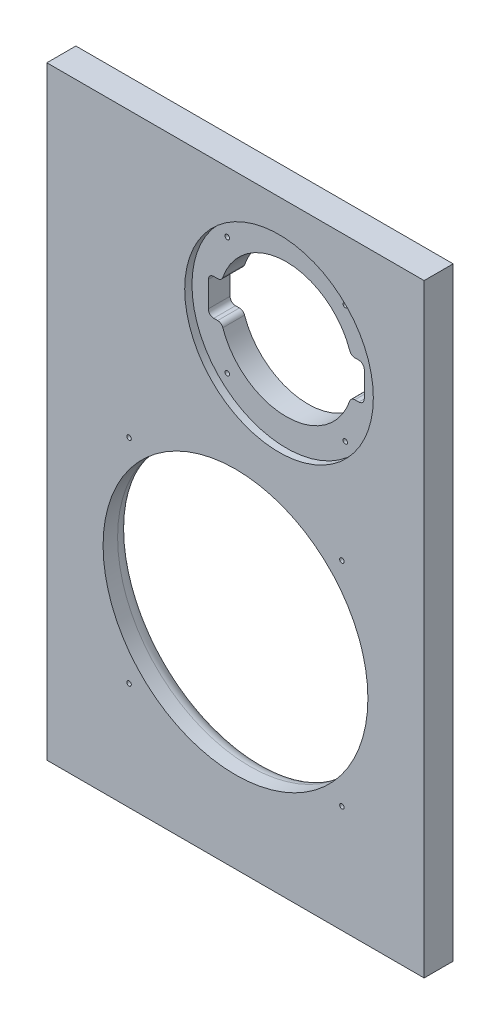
ISO-10303-21;
HEADER;
FILE_DESCRIPTION(('STEP AP214'),'2;1');
FILE_NAME('part.step','',(''),(''),'','','');
FILE_SCHEMA(('AUTOMOTIVE_DESIGN { 1 0 10303 214 1 1 1 1 }'));
ENDSEC;
DATA;
#1=APPLICATION_CONTEXT('core data for automotive mechanical design processes');
#2=APPLICATION_PROTOCOL_DEFINITION('international standard','automotive_design',2000,#1);
#3=PRODUCT_CONTEXT('',#1,'mechanical');
#4=PRODUCT('Part','Part','',(#3));
#5=PRODUCT_RELATED_PRODUCT_CATEGORY('part','',(#4));
#6=PRODUCT_DEFINITION_FORMATION('','',#4);
#7=PRODUCT_DEFINITION_CONTEXT('part definition',#1,'design');
#8=PRODUCT_DEFINITION('design','',#6,#7);
#9=PRODUCT_DEFINITION_SHAPE('','',#8);
#10=(LENGTH_UNIT() NAMED_UNIT(*) SI_UNIT(.MILLI.,.METRE.));
#11=(NAMED_UNIT(*) PLANE_ANGLE_UNIT() SI_UNIT($,.RADIAN.));
#12=(NAMED_UNIT(*) SI_UNIT($,.STERADIAN.) SOLID_ANGLE_UNIT());
#13=UNCERTAINTY_MEASURE_WITH_UNIT(LENGTH_MEASURE(1.E-05),#10,'distance_accuracy_value','');
#14=(GEOMETRIC_REPRESENTATION_CONTEXT(3) GLOBAL_UNCERTAINTY_ASSIGNED_CONTEXT((#13)) GLOBAL_UNIT_ASSIGNED_CONTEXT((#10,
#11,#12)) REPRESENTATION_CONTEXT('',''));
#15=CARTESIAN_POINT('',(0.,0.,0.));
#16=DIRECTION('',(0.,0.,1.));
#17=DIRECTION('',(1.,0.,0.));
#18=AXIS2_PLACEMENT_3D('',#15,#16,#17);
#19=CARTESIAN_POINT('',(208.,-10.,16.));
#20=DIRECTION('',(-1.,0.,0.));
#21=DIRECTION('',(0.,-1.,0.));
#22=AXIS2_PLACEMENT_3D('',#19,#20,#21);
#23=PLANE('',#22);
#24=DIRECTION('',(0.,1.,0.));
#25=VECTOR('',#24,1.);
#26=CARTESIAN_POINT('',(208.,-10.,0.));
#27=LINE('',#26,#25);
#28=CARTESIAN_POINT('',(208.,-343.,0.));
#29=VERTEX_POINT('',#28);
#30=CARTESIAN_POINT('',(208.,-10.,0.));
#31=VERTEX_POINT('',#30);
#32=EDGE_CURVE('E203',#29,#31,#27,.T.);
#33=ORIENTED_EDGE('',*,*,#32,.T.);
#34=DIRECTION('',(0.,0.,-1.));
#35=VECTOR('',#34,1.);
#36=CARTESIAN_POINT('',(208.,-10.,16.));
#37=LINE('',#36,#35);
#38=CARTESIAN_POINT('',(208.,-10.,16.));
#39=VERTEX_POINT('',#38);
#40=EDGE_CURVE('E174',#39,#31,#37,.T.);
#41=ORIENTED_EDGE('',*,*,#40,.F.);
#42=DIRECTION('',(0.,1.,0.));
#43=VECTOR('',#42,1.);
#44=CARTESIAN_POINT('',(208.,-10.,16.));
#45=LINE('',#44,#43);
#46=CARTESIAN_POINT('',(208.,-343.,16.));
#47=VERTEX_POINT('',#46);
#48=EDGE_CURVE('E204',#47,#39,#45,.T.);
#49=ORIENTED_EDGE('',*,*,#48,.F.);
#50=DIRECTION('',(0.,0.,-1.));
#51=VECTOR('',#50,1.);
#52=CARTESIAN_POINT('',(208.,-343.,16.));
#53=LINE('',#52,#51);
#54=EDGE_CURVE('E214',#47,#29,#53,.T.);
#55=ORIENTED_EDGE('',*,*,#54,.T.);
#56=EDGE_LOOP('',(#33,#41,#49,#55));
#57=FACE_BOUND('',#56,.T.);
#58=ADVANCED_FACE('F32',(#57),#23,.F.);
#59=CARTESIAN_POINT('',(0.,-10.,16.));
#60=DIRECTION('',(0.,-1.,0.));
#61=DIRECTION('',(0.,0.,-1.));
#62=AXIS2_PLACEMENT_3D('',#59,#60,#61);
#63=PLANE('',#62);
#64=DIRECTION('',(-1.,0.,0.));
#65=VECTOR('',#64,1.);
#66=CARTESIAN_POINT('',(0.,-10.,0.));
#67=LINE('',#66,#65);
#68=CARTESIAN_POINT('',(0.,-10.,0.));
#69=VERTEX_POINT('',#68);
#70=EDGE_CURVE('E217',#31,#69,#67,.T.);
#71=ORIENTED_EDGE('',*,*,#70,.T.);
#72=DIRECTION('',(0.,0.,-1.));
#73=VECTOR('',#72,1.);
#74=CARTESIAN_POINT('',(0.,-10.,16.));
#75=LINE('',#74,#73);
#76=CARTESIAN_POINT('',(0.,-10.,16.));
#77=VERTEX_POINT('',#76);
#78=EDGE_CURVE('E227',#77,#69,#75,.T.);
#79=ORIENTED_EDGE('',*,*,#78,.F.);
#80=DIRECTION('',(-1.,0.,0.));
#81=VECTOR('',#80,1.);
#82=CARTESIAN_POINT('',(0.,-10.,16.));
#83=LINE('',#82,#81);
#84=EDGE_CURVE('E207',#39,#77,#83,.T.);
#85=ORIENTED_EDGE('',*,*,#84,.F.);
#86=ORIENTED_EDGE('',*,*,#40,.T.);
#87=EDGE_LOOP('',(#71,#79,#85,#86));
#88=FACE_BOUND('',#87,.T.);
#89=ADVANCED_FACE('F266',(#88),#63,.F.);
#90=CARTESIAN_POINT('',(0.,-10.,16.));
#91=DIRECTION('',(1.,0.,0.));
#92=DIRECTION('',(0.,1.,0.));
#93=AXIS2_PLACEMENT_3D('',#90,#91,#92);
#94=PLANE('',#93);
#95=DIRECTION('',(0.,-1.,0.));
#96=VECTOR('',#95,1.);
#97=CARTESIAN_POINT('',(0.,-10.,0.));
#98=LINE('',#97,#96);
#99=CARTESIAN_POINT('',(0.,-343.,0.));
#100=VERTEX_POINT('',#99);
#101=EDGE_CURVE('E219',#69,#100,#98,.T.);
#102=ORIENTED_EDGE('',*,*,#101,.T.);
#103=DIRECTION('',(0.,0.,-1.));
#104=VECTOR('',#103,1.);
#105=CARTESIAN_POINT('',(0.,-343.,16.));
#106=LINE('',#105,#104);
#107=CARTESIAN_POINT('',(0.,-343.,16.));
#108=VERTEX_POINT('',#107);
#109=EDGE_CURVE('E224',#108,#100,#106,.T.);
#110=ORIENTED_EDGE('',*,*,#109,.F.);
#111=DIRECTION('',(0.,-1.,0.));
#112=VECTOR('',#111,1.);
#113=CARTESIAN_POINT('',(0.,-10.,16.));
#114=LINE('',#113,#112);
#115=EDGE_CURVE('E210',#77,#108,#114,.T.);
#116=ORIENTED_EDGE('',*,*,#115,.F.);
#117=ORIENTED_EDGE('',*,*,#78,.T.);
#118=EDGE_LOOP('',(#102,#110,#116,#117));
#119=FACE_BOUND('',#118,.T.);
#120=ADVANCED_FACE('F271',(#119),#94,.F.);
#121=CARTESIAN_POINT('',(0.,-343.,16.));
#122=DIRECTION('',(0.,1.,0.));
#123=DIRECTION('',(0.,0.,1.));
#124=AXIS2_PLACEMENT_3D('',#121,#122,#123);
#125=PLANE('',#124);
#126=DIRECTION('',(1.,0.,0.));
#127=VECTOR('',#126,1.);
#128=CARTESIAN_POINT('',(0.,-343.,0.));
#129=LINE('',#128,#127);
#130=EDGE_CURVE('E208',#100,#29,#129,.T.);
#131=ORIENTED_EDGE('',*,*,#130,.T.);
#132=ORIENTED_EDGE('',*,*,#54,.F.);
#133=DIRECTION('',(1.,0.,0.));
#134=VECTOR('',#133,1.);
#135=CARTESIAN_POINT('',(0.,-343.,16.));
#136=LINE('',#135,#134);
#137=EDGE_CURVE('E212',#108,#47,#136,.T.);
#138=ORIENTED_EDGE('',*,*,#137,.F.);
#139=ORIENTED_EDGE('',*,*,#109,.T.);
#140=EDGE_LOOP('',(#131,#132,#138,#139));
#141=FACE_BOUND('',#140,.T.);
#142=ADVANCED_FACE('F277',(#141),#125,.F.);
#143=CARTESIAN_POINT('',(208.,-343.,16.));
#144=DIRECTION('',(0.,0.,1.));
#145=DIRECTION('',(1.,0.,0.));
#146=AXIS2_PLACEMENT_3D('',#143,#144,#145);
#147=PLANE('',#146);
#148=CARTESIAN_POINT('',(162.689862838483,-283.687189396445,16.));
#149=DIRECTION('',(0.,0.,1.));
#150=DIRECTION('',(1.,0.,0.));
#151=AXIS2_PLACEMENT_3D('',#148,#149,#150);
#152=CIRCLE('',#151,1.25000000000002);
#153=CARTESIAN_POINT('',(163.939862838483,-283.687189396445,16.));
#154=VERTEX_POINT('',#153);
#155=EDGE_CURVE('E240',#154,#154,#152,.T.);
#156=ORIENTED_EDGE('',*,*,#155,.F.);
#157=EDGE_LOOP('',(#156));
#158=FACE_BOUND('',#157,.T.);
#159=CARTESIAN_POINT('',(162.689862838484,-166.307463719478,16.));
#160=DIRECTION('',(0.,0.,1.));
#161=DIRECTION('',(1.,0.,0.));
#162=AXIS2_PLACEMENT_3D('',#159,#160,#161);
#163=CIRCLE('',#162,1.24999999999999);
#164=CARTESIAN_POINT('',(163.939862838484,-166.307463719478,16.));
#165=VERTEX_POINT('',#164);
#166=EDGE_CURVE('E558',#165,#165,#163,.T.);
#167=ORIENTED_EDGE('',*,*,#166,.F.);
#168=EDGE_LOOP('',(#167));
#169=FACE_BOUND('',#168,.T.);
#170=CARTESIAN_POINT('',(45.3101371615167,-166.307463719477,16.));
#171=DIRECTION('',(0.,0.,1.));
#172=DIRECTION('',(1.,0.,0.));
#173=AXIS2_PLACEMENT_3D('',#170,#171,#172);
#174=CIRCLE('',#173,1.24999999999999);
#175=CARTESIAN_POINT('',(46.5601371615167,-166.307463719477,16.));
#176=VERTEX_POINT('',#175);
#177=EDGE_CURVE('E552',#176,#176,#174,.T.);
#178=ORIENTED_EDGE('',*,*,#177,.F.);
#179=EDGE_LOOP('',(#178));
#180=FACE_BOUND('',#179,.T.);
#181=CARTESIAN_POINT('',(45.3101371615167,-283.687189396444,16.));
#182=DIRECTION('',(0.,0.,1.));
#183=DIRECTION('',(1.,0.,0.));
#184=AXIS2_PLACEMENT_3D('',#181,#182,#183);
#185=CIRCLE('',#184,1.24999999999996);
#186=CARTESIAN_POINT('',(46.5601371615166,-283.687189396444,16.));
#187=VERTEX_POINT('',#186);
#188=EDGE_CURVE('E235',#187,#187,#185,.T.);
#189=ORIENTED_EDGE('',*,*,#188,.F.);
#190=EDGE_LOOP('',(#189));
#191=FACE_BOUND('',#190,.T.);
#192=CARTESIAN_POINT('',(128.,-79.997326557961,16.));
#193=DIRECTION('',(0.,0.,1.));
#194=DIRECTION('',(-1.,0.,0.));
#195=AXIS2_PLACEMENT_3D('',#192,#193,#194);
#196=CIRCLE('',#195,52.);
#197=CARTESIAN_POINT('',(76.,-79.997326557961,16.));
#198=VERTEX_POINT('',#197);
#199=EDGE_CURVE('E399',#198,#198,#196,.T.);
#200=ORIENTED_EDGE('',*,*,#199,.F.);
#201=EDGE_LOOP('',(#200));
#202=FACE_BOUND('',#201,.T.);
#203=CARTESIAN_POINT('',(104.,-224.997326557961,16.));
#204=DIRECTION('',(0.,0.,1.));
#205=DIRECTION('',(1.,0.,0.));
#206=AXIS2_PLACEMENT_3D('',#203,#204,#205);
#207=CIRCLE('',#206,73.0000000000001);
#208=CARTESIAN_POINT('',(177.,-224.997326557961,16.));
#209=VERTEX_POINT('',#208);
#210=EDGE_CURVE('E200',#209,#209,#207,.T.);
#211=ORIENTED_EDGE('',*,*,#210,.F.);
#212=EDGE_LOOP('',(#211));
#213=FACE_BOUND('',#212,.T.);
#214=ORIENTED_EDGE('',*,*,#48,.T.);
#215=ORIENTED_EDGE('',*,*,#84,.T.);
#216=ORIENTED_EDGE('',*,*,#115,.T.);
#217=ORIENTED_EDGE('',*,*,#137,.T.);
#218=EDGE_LOOP('',(#214,#215,#216,#217));
#219=FACE_BOUND('',#218,.T.);
#220=ADVANCED_FACE('F281',(#158,#169,#180,#191,#202,#213,#219),#147,.T.);
#221=CARTESIAN_POINT('',(208.,-343.,0.));
#222=DIRECTION('',(0.,0.,1.));
#223=DIRECTION('',(1.,0.,0.));
#224=AXIS2_PLACEMENT_3D('',#221,#222,#223);
#225=PLANE('',#224);
#226=CARTESIAN_POINT('',(104.,-224.997326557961,0.));
#227=DIRECTION('',(0.,0.,1.));
#228=DIRECTION('',(1.,0.,0.));
#229=AXIS2_PLACEMENT_3D('',#226,#227,#228);
#230=CIRCLE('',#229,81.0000000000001);
#231=CARTESIAN_POINT('',(185.,-224.997326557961,0.));
#232=VERTEX_POINT('',#231);
#233=EDGE_CURVE('E40',#232,#232,#230,.T.);
#234=ORIENTED_EDGE('',*,*,#233,.T.);
#235=EDGE_LOOP('',(#234));
#236=FACE_BOUND('',#235,.T.);
#237=CARTESIAN_POINT('',(95.4730880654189,-47.4704146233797,0.));
#238=DIRECTION('',(0.,0.,1.));
#239=DIRECTION('',(-1.,0.,0.));
#240=AXIS2_PLACEMENT_3D('',#237,#238,#239);
#241=CIRCLE('',#240,1.25);
#242=CARTESIAN_POINT('',(94.2230880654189,-47.4704146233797,0.));
#243=VERTEX_POINT('',#242);
#244=EDGE_CURVE('E248',#243,#243,#241,.T.);
#245=ORIENTED_EDGE('',*,*,#244,.T.);
#246=EDGE_LOOP('',(#245));
#247=FACE_BOUND('',#246,.T.);
#248=CARTESIAN_POINT('',(95.473088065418,-112.524238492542,0.));
#249=DIRECTION('',(0.,0.,1.));
#250=DIRECTION('',(-1.,0.,0.));
#251=AXIS2_PLACEMENT_3D('',#248,#249,#250);
#252=CIRCLE('',#251,1.25);
#253=CARTESIAN_POINT('',(94.223088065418,-112.524238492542,0.));
#254=VERTEX_POINT('',#253);
#255=EDGE_CURVE('E245',#254,#254,#252,.T.);
#256=ORIENTED_EDGE('',*,*,#255,.T.);
#257=EDGE_LOOP('',(#256));
#258=FACE_BOUND('',#257,.T.);
#259=CARTESIAN_POINT('',(160.52691193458,-112.524238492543,0.));
#260=DIRECTION('',(0.,0.,1.));
#261=DIRECTION('',(-1.,0.,0.));
#262=AXIS2_PLACEMENT_3D('',#259,#260,#261);
#263=CIRCLE('',#262,1.24999999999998);
#264=CARTESIAN_POINT('',(159.27691193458,-112.524238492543,0.));
#265=VERTEX_POINT('',#264);
#266=EDGE_CURVE('E241',#265,#265,#263,.T.);
#267=ORIENTED_EDGE('',*,*,#266,.T.);
#268=EDGE_LOOP('',(#267));
#269=FACE_BOUND('',#268,.T.);
#270=CARTESIAN_POINT('',(162.689862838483,-283.687189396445,0.));
#271=DIRECTION('',(0.,0.,1.));
#272=DIRECTION('',(1.,0.,0.));
#273=AXIS2_PLACEMENT_3D('',#270,#271,#272);
#274=CIRCLE('',#273,1.25000000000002);
#275=CARTESIAN_POINT('',(163.939862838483,-283.687189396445,0.));
#276=VERTEX_POINT('',#275);
#277=EDGE_CURVE('E561',#276,#276,#274,.T.);
#278=ORIENTED_EDGE('',*,*,#277,.T.);
#279=EDGE_LOOP('',(#278));
#280=FACE_BOUND('',#279,.T.);
#281=CARTESIAN_POINT('',(162.689862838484,-166.307463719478,0.));
#282=DIRECTION('',(0.,0.,1.));
#283=DIRECTION('',(1.,0.,0.));
#284=AXIS2_PLACEMENT_3D('',#281,#282,#283);
#285=CIRCLE('',#284,1.24999999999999);
#286=CARTESIAN_POINT('',(163.939862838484,-166.307463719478,0.));
#287=VERTEX_POINT('',#286);
#288=EDGE_CURVE('E555',#287,#287,#285,.T.);
#289=ORIENTED_EDGE('',*,*,#288,.T.);
#290=EDGE_LOOP('',(#289));
#291=FACE_BOUND('',#290,.T.);
#292=CARTESIAN_POINT('',(45.3101371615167,-166.307463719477,0.));
#293=DIRECTION('',(0.,0.,1.));
#294=DIRECTION('',(1.,0.,0.));
#295=AXIS2_PLACEMENT_3D('',#292,#293,#294);
#296=CIRCLE('',#295,1.24999999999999);
#297=CARTESIAN_POINT('',(46.5601371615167,-166.307463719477,0.));
#298=VERTEX_POINT('',#297);
#299=EDGE_CURVE('E551',#298,#298,#296,.T.);
#300=ORIENTED_EDGE('',*,*,#299,.T.);
#301=EDGE_LOOP('',(#300));
#302=FACE_BOUND('',#301,.T.);
#303=CARTESIAN_POINT('',(160.526911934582,-47.4704146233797,0.));
#304=DIRECTION('',(0.,0.,1.));
#305=DIRECTION('',(-1.,0.,0.));
#306=AXIS2_PLACEMENT_3D('',#303,#304,#305);
#307=CIRCLE('',#306,1.24999999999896);
#308=CARTESIAN_POINT('',(159.276911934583,-47.4704146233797,0.));
#309=VERTEX_POINT('',#308);
#310=EDGE_CURVE('E236',#309,#309,#307,.T.);
#311=ORIENTED_EDGE('',*,*,#310,.T.);
#312=EDGE_LOOP('',(#311));
#313=FACE_BOUND('',#312,.T.);
#314=CARTESIAN_POINT('',(45.3101371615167,-283.687189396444,0.));
#315=DIRECTION('',(0.,0.,1.));
#316=DIRECTION('',(1.,0.,0.));
#317=AXIS2_PLACEMENT_3D('',#314,#315,#316);
#318=CIRCLE('',#317,1.24999999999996);
#319=CARTESIAN_POINT('',(46.5601371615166,-283.687189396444,0.));
#320=VERTEX_POINT('',#319);
#321=EDGE_CURVE('E404',#320,#320,#318,.T.);
#322=ORIENTED_EDGE('',*,*,#321,.T.);
#323=EDGE_LOOP('',(#322));
#324=FACE_BOUND('',#323,.T.);
#325=CARTESIAN_POINT('',(128.,-79.9973265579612,0.));
#326=DIRECTION('',(0.,0.,1.));
#327=DIRECTION('',(-1.,0.,0.));
#328=AXIS2_PLACEMENT_3D('',#325,#326,#327);
#329=CIRCLE('',#328,37.);
#330=CARTESIAN_POINT('',(93.0085814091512,-92.0223265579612,0.));
#331=VERTEX_POINT('',#330);
#332=CARTESIAN_POINT('',(162.991418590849,-92.0223265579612,0.));
#333=VERTEX_POINT('',#332);
#334=EDGE_CURVE('E191',#331,#333,#329,.T.);
#335=ORIENTED_EDGE('',*,*,#334,.T.);
#336=CARTESIAN_POINT('',(165.828560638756,-92.9973265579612,0.));
#337=DIRECTION('',(0.,0.,-1.));
#338=DIRECTION('',(1.,0.,0.));
#339=AXIS2_PLACEMENT_3D('',#336,#337,#338);
#340=CIRCLE('',#339,3.);
#341=CARTESIAN_POINT('',(165.828560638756,-89.9973265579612,0.));
#342=VERTEX_POINT('',#341);
#343=EDGE_CURVE('E183',#333,#342,#340,.T.);
#344=ORIENTED_EDGE('',*,*,#343,.T.);
#345=DIRECTION('',(1.,0.,0.));
#346=VECTOR('',#345,1.);
#347=CARTESIAN_POINT('',(168.,-89.9973265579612,0.));
#348=LINE('',#347,#346);
#349=CARTESIAN_POINT('',(168.,-89.9973265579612,0.));
#350=VERTEX_POINT('',#349);
#351=EDGE_CURVE('E188',#342,#350,#348,.T.);
#352=ORIENTED_EDGE('',*,*,#351,.T.);
#353=CARTESIAN_POINT('',(168.,-86.9973265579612,0.));
#354=DIRECTION('',(0.,0.,1.));
#355=DIRECTION('',(-1.,0.,0.));
#356=AXIS2_PLACEMENT_3D('',#353,#354,#355);
#357=CIRCLE('',#356,3.);
#358=CARTESIAN_POINT('',(171.,-86.9973265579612,0.));
#359=VERTEX_POINT('',#358);
#360=EDGE_CURVE('E55',#350,#359,#357,.T.);
#361=ORIENTED_EDGE('',*,*,#360,.T.);
#362=DIRECTION('',(0.,1.,0.));
#363=VECTOR('',#362,1.);
#364=CARTESIAN_POINT('',(171.,-72.9973265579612,0.));
#365=LINE('',#364,#363);
#366=CARTESIAN_POINT('',(171.,-72.9973265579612,0.));
#367=VERTEX_POINT('',#366);
#368=EDGE_CURVE('E448',#359,#367,#365,.T.);
#369=ORIENTED_EDGE('',*,*,#368,.T.);
#370=CARTESIAN_POINT('',(168.,-72.9973265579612,0.));
#371=DIRECTION('',(0.,0.,1.));
#372=DIRECTION('',(1.,0.,0.));
#373=AXIS2_PLACEMENT_3D('',#370,#371,#372);
#374=CIRCLE('',#373,3.);
#375=CARTESIAN_POINT('',(168.,-69.9973265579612,0.));
#376=VERTEX_POINT('',#375);
#377=EDGE_CURVE('E451',#367,#376,#374,.T.);
#378=ORIENTED_EDGE('',*,*,#377,.T.);
#379=DIRECTION('',(-1.,0.,0.));
#380=VECTOR('',#379,1.);
#381=CARTESIAN_POINT('',(168.,-69.9973265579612,0.));
#382=LINE('',#381,#380);
#383=CARTESIAN_POINT('',(165.828560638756,-69.9973265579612,0.));
#384=VERTEX_POINT('',#383);
#385=EDGE_CURVE('E454',#376,#384,#382,.T.);
#386=ORIENTED_EDGE('',*,*,#385,.T.);
#387=CARTESIAN_POINT('',(165.828560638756,-66.9973265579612,0.));
#388=DIRECTION('',(0.,0.,-1.));
#389=DIRECTION('',(-1.,0.,0.));
#390=AXIS2_PLACEMENT_3D('',#387,#388,#389);
#391=CIRCLE('',#390,3.);
#392=CARTESIAN_POINT('',(162.991418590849,-67.9723265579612,0.));
#393=VERTEX_POINT('',#392);
#394=EDGE_CURVE('E457',#384,#393,#391,.T.);
#395=ORIENTED_EDGE('',*,*,#394,.T.);
#396=CARTESIAN_POINT('',(128.,-79.9973265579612,0.));
#397=DIRECTION('',(0.,0.,1.));
#398=DIRECTION('',(-1.,0.,0.));
#399=AXIS2_PLACEMENT_3D('',#396,#397,#398);
#400=CIRCLE('',#399,37.);
#401=CARTESIAN_POINT('',(93.0085814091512,-67.9723265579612,0.));
#402=VERTEX_POINT('',#401);
#403=EDGE_CURVE('E460',#393,#402,#400,.T.);
#404=ORIENTED_EDGE('',*,*,#403,.T.);
#405=CARTESIAN_POINT('',(90.1714393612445,-66.9973265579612,0.));
#406=DIRECTION('',(0.,0.,-1.));
#407=DIRECTION('',(-1.,0.,0.));
#408=AXIS2_PLACEMENT_3D('',#405,#406,#407);
#409=CIRCLE('',#408,3.);
#410=CARTESIAN_POINT('',(90.1714393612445,-69.9973265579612,0.));
#411=VERTEX_POINT('',#410);
#412=EDGE_CURVE('E463',#402,#411,#409,.T.);
#413=ORIENTED_EDGE('',*,*,#412,.T.);
#414=DIRECTION('',(-1.,0.,0.));
#415=VECTOR('',#414,1.);
#416=CARTESIAN_POINT('',(90.1714393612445,-69.9973265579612,0.));
#417=LINE('',#416,#415);
#418=CARTESIAN_POINT('',(88.,-69.9973265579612,0.));
#419=VERTEX_POINT('',#418);
#420=EDGE_CURVE('E466',#411,#419,#417,.T.);
#421=ORIENTED_EDGE('',*,*,#420,.T.);
#422=CARTESIAN_POINT('',(88.,-72.9973265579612,0.));
#423=DIRECTION('',(0.,0.,1.));
#424=DIRECTION('',(-1.,0.,0.));
#425=AXIS2_PLACEMENT_3D('',#422,#423,#424);
#426=CIRCLE('',#425,3.);
#427=CARTESIAN_POINT('',(85.,-72.9973265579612,0.));
#428=VERTEX_POINT('',#427);
#429=EDGE_CURVE('E469',#419,#428,#426,.T.);
#430=ORIENTED_EDGE('',*,*,#429,.T.);
#431=DIRECTION('',(0.,-1.,0.));
#432=VECTOR('',#431,1.);
#433=CARTESIAN_POINT('',(85.,-72.9973265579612,0.));
#434=LINE('',#433,#432);
#435=CARTESIAN_POINT('',(85.,-86.9973265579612,0.));
#436=VERTEX_POINT('',#435);
#437=EDGE_CURVE('E472',#428,#436,#434,.T.);
#438=ORIENTED_EDGE('',*,*,#437,.T.);
#439=CARTESIAN_POINT('',(88.,-86.9973265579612,0.));
#440=DIRECTION('',(0.,0.,1.));
#441=DIRECTION('',(1.,0.,0.));
#442=AXIS2_PLACEMENT_3D('',#439,#440,#441);
#443=CIRCLE('',#442,3.);
#444=CARTESIAN_POINT('',(88.,-89.9973265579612,0.));
#445=VERTEX_POINT('',#444);
#446=EDGE_CURVE('E475',#436,#445,#443,.T.);
#447=ORIENTED_EDGE('',*,*,#446,.T.);
#448=DIRECTION('',(1.,0.,0.));
#449=VECTOR('',#448,1.);
#450=CARTESIAN_POINT('',(90.1714393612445,-89.9973265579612,0.));
#451=LINE('',#450,#449);
#452=CARTESIAN_POINT('',(90.1714393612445,-89.9973265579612,0.));
#453=VERTEX_POINT('',#452);
#454=EDGE_CURVE('E478',#445,#453,#451,.T.);
#455=ORIENTED_EDGE('',*,*,#454,.T.);
#456=CARTESIAN_POINT('',(90.1714393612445,-92.9973265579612,0.));
#457=DIRECTION('',(0.,0.,-1.));
#458=DIRECTION('',(1.,0.,0.));
#459=AXIS2_PLACEMENT_3D('',#456,#457,#458);
#460=CIRCLE('',#459,3.00000000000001);
#461=EDGE_CURVE('E196',#453,#331,#460,.T.);
#462=ORIENTED_EDGE('',*,*,#461,.T.);
#463=EDGE_LOOP('',(#335,#344,#352,#361,#369,#378,#386,#395,#404,#413,#421,#430,#438,#447,#455,#462));
#464=FACE_BOUND('',#463,.T.);
#465=ORIENTED_EDGE('',*,*,#32,.F.);
#466=ORIENTED_EDGE('',*,*,#130,.F.);
#467=ORIENTED_EDGE('',*,*,#101,.F.);
#468=ORIENTED_EDGE('',*,*,#70,.F.);
#469=EDGE_LOOP('',(#465,#466,#467,#468));
#470=FACE_BOUND('',#469,.T.);
#471=ADVANCED_FACE('F252',(#236,#247,#258,#269,#280,#291,#302,#313,#324,#464,#470),#225,.F.);
#472=CARTESIAN_POINT('',(104.,-224.997326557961,0.));
#473=DIRECTION('',(0.,0.,1.));
#474=DIRECTION('',(1.,0.,0.));
#475=AXIS2_PLACEMENT_3D('',#472,#473,#474);
#476=CYLINDRICAL_SURFACE('',#475,73.0000000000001);
#477=CARTESIAN_POINT('',(104.,-224.997326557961,8.));
#478=DIRECTION('',(0.,0.,1.));
#479=DIRECTION('',(1.,0.,0.));
#480=AXIS2_PLACEMENT_3D('',#477,#478,#479);
#481=CIRCLE('',#480,73.0000000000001);
#482=CARTESIAN_POINT('',(177.,-224.997326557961,8.));
#483=VERTEX_POINT('',#482);
#484=EDGE_CURVE('E11',#483,#483,#481,.F.);
#485=ORIENTED_EDGE('',*,*,#484,.T.);
#486=EDGE_LOOP('',(#485));
#487=FACE_BOUND('',#486,.T.);
#488=ORIENTED_EDGE('',*,*,#210,.T.);
#489=EDGE_LOOP('',(#488));
#490=FACE_BOUND('',#489,.T.);
#491=ADVANCED_FACE('F285',(#487,#490),#476,.F.);
#492=CARTESIAN_POINT('',(165.828560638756,-92.9973265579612,0.));
#493=DIRECTION('',(0.,0.,1.));
#494=DIRECTION('',(1.,0.,0.));
#495=AXIS2_PLACEMENT_3D('',#492,#493,#494);
#496=CYLINDRICAL_SURFACE('',#495,3.);
#497=DIRECTION('',(0.,0.,1.));
#498=VECTOR('',#497,1.);
#499=CARTESIAN_POINT('',(162.991418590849,-92.0223265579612,0.));
#500=LINE('',#499,#498);
#501=CARTESIAN_POINT('',(162.991418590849,-92.0223265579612,12.));
#502=VERTEX_POINT('',#501);
#503=EDGE_CURVE('E182',#333,#502,#500,.T.);
#504=ORIENTED_EDGE('',*,*,#503,.T.);
#505=CARTESIAN_POINT('',(165.828560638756,-92.9973265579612,12.));
#506=DIRECTION('',(0.,0.,-1.));
#507=DIRECTION('',(-1.,0.,0.));
#508=AXIS2_PLACEMENT_3D('',#505,#506,#507);
#509=CIRCLE('',#508,3.);
#510=CARTESIAN_POINT('',(165.828560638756,-89.9973265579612,12.));
#511=VERTEX_POINT('',#510);
#512=EDGE_CURVE('E170',#502,#511,#509,.T.);
#513=ORIENTED_EDGE('',*,*,#512,.T.);
#514=DIRECTION('',(0.,0.,1.));
#515=VECTOR('',#514,1.);
#516=CARTESIAN_POINT('',(165.828560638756,-89.9973265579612,0.));
#517=LINE('',#516,#515);
#518=EDGE_CURVE('E180',#342,#511,#517,.T.);
#519=ORIENTED_EDGE('',*,*,#518,.F.);
#520=ORIENTED_EDGE('',*,*,#343,.F.);
#521=EDGE_LOOP('',(#504,#513,#519,#520));
#522=FACE_BOUND('',#521,.T.);
#523=ADVANCED_FACE('F178',(#522),#496,.T.);
#524=CARTESIAN_POINT('',(128.,-79.9973265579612,0.));
#525=DIRECTION('',(0.,0.,1.));
#526=DIRECTION('',(1.,0.,0.));
#527=AXIS2_PLACEMENT_3D('',#524,#525,#526);
#528=CYLINDRICAL_SURFACE('',#527,37.);
#529=DIRECTION('',(0.,0.,1.));
#530=VECTOR('',#529,1.);
#531=CARTESIAN_POINT('',(93.0085814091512,-92.0223265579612,0.));
#532=LINE('',#531,#530);
#533=CARTESIAN_POINT('',(93.0085814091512,-92.0223265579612,12.));
#534=VERTEX_POINT('',#533);
#535=EDGE_CURVE('E484',#331,#534,#532,.T.);
#536=ORIENTED_EDGE('',*,*,#535,.T.);
#537=CARTESIAN_POINT('',(128.,-79.9973265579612,12.));
#538=DIRECTION('',(0.,0.,-1.));
#539=DIRECTION('',(-1.,0.,0.));
#540=AXIS2_PLACEMENT_3D('',#537,#538,#539);
#541=CIRCLE('',#540,37.);
#542=EDGE_CURVE('E184',#534,#502,#541,.F.);
#543=ORIENTED_EDGE('',*,*,#542,.T.);
#544=ORIENTED_EDGE('',*,*,#503,.F.);
#545=ORIENTED_EDGE('',*,*,#334,.F.);
#546=EDGE_LOOP('',(#536,#543,#544,#545));
#547=FACE_BOUND('',#546,.T.);
#548=ADVANCED_FACE('F294',(#547),#528,.F.);
#549=CARTESIAN_POINT('',(90.1714393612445,-92.9973265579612,0.));
#550=DIRECTION('',(0.,0.,1.));
#551=DIRECTION('',(1.,0.,0.));
#552=AXIS2_PLACEMENT_3D('',#549,#550,#551);
#553=CYLINDRICAL_SURFACE('',#552,3.00000000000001);
#554=DIRECTION('',(0.,0.,1.));
#555=VECTOR('',#554,1.);
#556=CARTESIAN_POINT('',(90.1714393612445,-89.9973265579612,0.));
#557=LINE('',#556,#555);
#558=CARTESIAN_POINT('',(90.1714393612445,-89.9973265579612,12.));
#559=VERTEX_POINT('',#558);
#560=EDGE_CURVE('E487',#453,#559,#557,.T.);
#561=ORIENTED_EDGE('',*,*,#560,.T.);
#562=CARTESIAN_POINT('',(90.1714393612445,-92.9973265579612,12.));
#563=DIRECTION('',(0.,0.,-1.));
#564=DIRECTION('',(-1.,0.,0.));
#565=AXIS2_PLACEMENT_3D('',#562,#563,#564);
#566=CIRCLE('',#565,3.00000000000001);
#567=EDGE_CURVE('E441',#559,#534,#566,.T.);
#568=ORIENTED_EDGE('',*,*,#567,.T.);
#569=ORIENTED_EDGE('',*,*,#535,.F.);
#570=ORIENTED_EDGE('',*,*,#461,.F.);
#571=EDGE_LOOP('',(#561,#568,#569,#570));
#572=FACE_BOUND('',#571,.T.);
#573=ADVANCED_FACE('F343',(#572),#553,.T.);
#574=CARTESIAN_POINT('',(90.1714393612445,-89.9973265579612,0.));
#575=DIRECTION('',(0.,-1.,0.));
#576=DIRECTION('',(0.,0.,-1.));
#577=AXIS2_PLACEMENT_3D('',#574,#575,#576);
#578=PLANE('',#577);
#579=DIRECTION('',(0.,0.,1.));
#580=VECTOR('',#579,1.);
#581=CARTESIAN_POINT('',(88.,-89.9973265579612,0.));
#582=LINE('',#581,#580);
#583=CARTESIAN_POINT('',(88.,-89.9973265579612,12.));
#584=VERTEX_POINT('',#583);
#585=EDGE_CURVE('E490',#445,#584,#582,.T.);
#586=ORIENTED_EDGE('',*,*,#585,.T.);
#587=DIRECTION('',(1.,0.,0.));
#588=VECTOR('',#587,1.);
#589=CARTESIAN_POINT('',(90.1714393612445,-89.9973265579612,12.));
#590=LINE('',#589,#588);
#591=EDGE_CURVE('E438',#584,#559,#590,.T.);
#592=ORIENTED_EDGE('',*,*,#591,.T.);
#593=ORIENTED_EDGE('',*,*,#560,.F.);
#594=ORIENTED_EDGE('',*,*,#454,.F.);
#595=EDGE_LOOP('',(#586,#592,#593,#594));
#596=FACE_BOUND('',#595,.T.);
#597=ADVANCED_FACE('F339',(#596),#578,.F.);
#598=CARTESIAN_POINT('',(88.,-86.9973265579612,0.));
#599=DIRECTION('',(0.,0.,1.));
#600=DIRECTION('',(1.,0.,0.));
#601=AXIS2_PLACEMENT_3D('',#598,#599,#600);
#602=CYLINDRICAL_SURFACE('',#601,3.);
#603=DIRECTION('',(0.,0.,1.));
#604=VECTOR('',#603,1.);
#605=CARTESIAN_POINT('',(85.,-86.9973265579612,0.));
#606=LINE('',#605,#604);
#607=CARTESIAN_POINT('',(85.,-86.9973265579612,12.));
#608=VERTEX_POINT('',#607);
#609=EDGE_CURVE('E493',#436,#608,#606,.T.);
#610=ORIENTED_EDGE('',*,*,#609,.T.);
#611=CARTESIAN_POINT('',(88.,-86.9973265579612,12.));
#612=DIRECTION('',(0.,0.,-1.));
#613=DIRECTION('',(-1.,0.,0.));
#614=AXIS2_PLACEMENT_3D('',#611,#612,#613);
#615=CIRCLE('',#614,3.);
#616=EDGE_CURVE('E435',#608,#584,#615,.F.);
#617=ORIENTED_EDGE('',*,*,#616,.T.);
#618=ORIENTED_EDGE('',*,*,#585,.F.);
#619=ORIENTED_EDGE('',*,*,#446,.F.);
#620=EDGE_LOOP('',(#610,#617,#618,#619));
#621=FACE_BOUND('',#620,.T.);
#622=ADVANCED_FACE('F335',(#621),#602,.F.);
#623=CARTESIAN_POINT('',(85.,-72.9973265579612,0.));
#624=DIRECTION('',(-1.,0.,0.));
#625=DIRECTION('',(0.,0.,1.));
#626=AXIS2_PLACEMENT_3D('',#623,#624,#625);
#627=PLANE('',#626);
#628=DIRECTION('',(0.,0.,1.));
#629=VECTOR('',#628,1.);
#630=CARTESIAN_POINT('',(85.,-72.9973265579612,0.));
#631=LINE('',#630,#629);
#632=CARTESIAN_POINT('',(85.,-72.9973265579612,12.));
#633=VERTEX_POINT('',#632);
#634=EDGE_CURVE('E496',#428,#633,#631,.T.);
#635=ORIENTED_EDGE('',*,*,#634,.T.);
#636=DIRECTION('',(0.,-1.,0.));
#637=VECTOR('',#636,1.);
#638=CARTESIAN_POINT('',(85.,-72.9973265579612,12.));
#639=LINE('',#638,#637);
#640=EDGE_CURVE('E432',#633,#608,#639,.T.);
#641=ORIENTED_EDGE('',*,*,#640,.T.);
#642=ORIENTED_EDGE('',*,*,#609,.F.);
#643=ORIENTED_EDGE('',*,*,#437,.F.);
#644=EDGE_LOOP('',(#635,#641,#642,#643));
#645=FACE_BOUND('',#644,.T.);
#646=ADVANCED_FACE('F331',(#645),#627,.F.);
#647=CARTESIAN_POINT('',(88.,-72.9973265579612,0.));
#648=DIRECTION('',(0.,0.,1.));
#649=DIRECTION('',(1.,0.,0.));
#650=AXIS2_PLACEMENT_3D('',#647,#648,#649);
#651=CYLINDRICAL_SURFACE('',#650,3.);
#652=DIRECTION('',(0.,0.,1.));
#653=VECTOR('',#652,1.);
#654=CARTESIAN_POINT('',(88.,-69.9973265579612,0.));
#655=LINE('',#654,#653);
#656=CARTESIAN_POINT('',(88.,-69.9973265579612,12.));
#657=VERTEX_POINT('',#656);
#658=EDGE_CURVE('E499',#419,#657,#655,.T.);
#659=ORIENTED_EDGE('',*,*,#658,.T.);
#660=CARTESIAN_POINT('',(88.,-72.9973265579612,12.));
#661=DIRECTION('',(0.,0.,-1.));
#662=DIRECTION('',(-1.,0.,0.));
#663=AXIS2_PLACEMENT_3D('',#660,#661,#662);
#664=CIRCLE('',#663,3.);
#665=EDGE_CURVE('E429',#657,#633,#664,.F.);
#666=ORIENTED_EDGE('',*,*,#665,.T.);
#667=ORIENTED_EDGE('',*,*,#634,.F.);
#668=ORIENTED_EDGE('',*,*,#429,.F.);
#669=EDGE_LOOP('',(#659,#666,#667,#668));
#670=FACE_BOUND('',#669,.T.);
#671=ADVANCED_FACE('F327',(#670),#651,.F.);
#672=CARTESIAN_POINT('',(90.1714393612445,-69.9973265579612,0.));
#673=DIRECTION('',(0.,1.,0.));
#674=DIRECTION('',(0.,0.,1.));
#675=AXIS2_PLACEMENT_3D('',#672,#673,#674);
#676=PLANE('',#675);
#677=DIRECTION('',(0.,0.,1.));
#678=VECTOR('',#677,1.);
#679=CARTESIAN_POINT('',(90.1714393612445,-69.9973265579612,0.));
#680=LINE('',#679,#678);
#681=CARTESIAN_POINT('',(90.1714393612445,-69.9973265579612,12.));
#682=VERTEX_POINT('',#681);
#683=EDGE_CURVE('E502',#411,#682,#680,.T.);
#684=ORIENTED_EDGE('',*,*,#683,.T.);
#685=DIRECTION('',(-1.,0.,0.));
#686=VECTOR('',#685,1.);
#687=CARTESIAN_POINT('',(90.1714393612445,-69.9973265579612,12.));
#688=LINE('',#687,#686);
#689=EDGE_CURVE('E426',#682,#657,#688,.T.);
#690=ORIENTED_EDGE('',*,*,#689,.T.);
#691=ORIENTED_EDGE('',*,*,#658,.F.);
#692=ORIENTED_EDGE('',*,*,#420,.F.);
#693=EDGE_LOOP('',(#684,#690,#691,#692));
#694=FACE_BOUND('',#693,.T.);
#695=ADVANCED_FACE('F323',(#694),#676,.F.);
#696=CARTESIAN_POINT('',(90.1714393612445,-66.9973265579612,0.));
#697=DIRECTION('',(0.,0.,1.));
#698=DIRECTION('',(1.,0.,0.));
#699=AXIS2_PLACEMENT_3D('',#696,#697,#698);
#700=CYLINDRICAL_SURFACE('',#699,3.);
#701=DIRECTION('',(0.,0.,1.));
#702=VECTOR('',#701,1.);
#703=CARTESIAN_POINT('',(93.0085814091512,-67.9723265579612,0.));
#704=LINE('',#703,#702);
#705=CARTESIAN_POINT('',(93.0085814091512,-67.9723265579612,12.));
#706=VERTEX_POINT('',#705);
#707=EDGE_CURVE('E505',#402,#706,#704,.T.);
#708=ORIENTED_EDGE('',*,*,#707,.T.);
#709=CARTESIAN_POINT('',(90.1714393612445,-66.9973265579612,12.));
#710=DIRECTION('',(0.,0.,-1.));
#711=DIRECTION('',(-1.,0.,0.));
#712=AXIS2_PLACEMENT_3D('',#709,#710,#711);
#713=CIRCLE('',#712,3.);
#714=EDGE_CURVE('E423',#706,#682,#713,.T.);
#715=ORIENTED_EDGE('',*,*,#714,.T.);
#716=ORIENTED_EDGE('',*,*,#683,.F.);
#717=ORIENTED_EDGE('',*,*,#412,.F.);
#718=EDGE_LOOP('',(#708,#715,#716,#717));
#719=FACE_BOUND('',#718,.T.);
#720=ADVANCED_FACE('F319',(#719),#700,.T.);
#721=CARTESIAN_POINT('',(128.,-79.9973265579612,0.));
#722=DIRECTION('',(0.,0.,1.));
#723=DIRECTION('',(1.,0.,0.));
#724=AXIS2_PLACEMENT_3D('',#721,#722,#723);
#725=CYLINDRICAL_SURFACE('',#724,37.);
#726=DIRECTION('',(0.,0.,1.));
#727=VECTOR('',#726,1.);
#728=CARTESIAN_POINT('',(162.991418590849,-67.9723265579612,0.));
#729=LINE('',#728,#727);
#730=CARTESIAN_POINT('',(162.991418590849,-67.9723265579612,12.));
#731=VERTEX_POINT('',#730);
#732=EDGE_CURVE('E508',#393,#731,#729,.T.);
#733=ORIENTED_EDGE('',*,*,#732,.T.);
#734=CARTESIAN_POINT('',(128.,-79.9973265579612,12.));
#735=DIRECTION('',(0.,0.,-1.));
#736=DIRECTION('',(-1.,0.,0.));
#737=AXIS2_PLACEMENT_3D('',#734,#735,#736);
#738=CIRCLE('',#737,37.);
#739=EDGE_CURVE('E420',#731,#706,#738,.F.);
#740=ORIENTED_EDGE('',*,*,#739,.T.);
#741=ORIENTED_EDGE('',*,*,#707,.F.);
#742=ORIENTED_EDGE('',*,*,#403,.F.);
#743=EDGE_LOOP('',(#733,#740,#741,#742));
#744=FACE_BOUND('',#743,.T.);
#745=ADVANCED_FACE('F315',(#744),#725,.F.);
#746=CARTESIAN_POINT('',(165.828560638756,-66.9973265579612,0.));
#747=DIRECTION('',(0.,0.,1.));
#748=DIRECTION('',(1.,0.,0.));
#749=AXIS2_PLACEMENT_3D('',#746,#747,#748);
#750=CYLINDRICAL_SURFACE('',#749,3.);
#751=DIRECTION('',(0.,0.,1.));
#752=VECTOR('',#751,1.);
#753=CARTESIAN_POINT('',(165.828560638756,-69.9973265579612,0.));
#754=LINE('',#753,#752);
#755=CARTESIAN_POINT('',(165.828560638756,-69.9973265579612,12.));
#756=VERTEX_POINT('',#755);
#757=EDGE_CURVE('E511',#384,#756,#754,.T.);
#758=ORIENTED_EDGE('',*,*,#757,.T.);
#759=CARTESIAN_POINT('',(165.828560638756,-66.9973265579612,12.));
#760=DIRECTION('',(0.,0.,-1.));
#761=DIRECTION('',(-1.,0.,0.));
#762=AXIS2_PLACEMENT_3D('',#759,#760,#761);
#763=CIRCLE('',#762,3.);
#764=EDGE_CURVE('E417',#756,#731,#763,.T.);
#765=ORIENTED_EDGE('',*,*,#764,.T.);
#766=ORIENTED_EDGE('',*,*,#732,.F.);
#767=ORIENTED_EDGE('',*,*,#394,.F.);
#768=EDGE_LOOP('',(#758,#765,#766,#767));
#769=FACE_BOUND('',#768,.T.);
#770=ADVANCED_FACE('F311',(#769),#750,.T.);
#771=CARTESIAN_POINT('',(168.,-69.9973265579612,0.));
#772=DIRECTION('',(0.,1.,0.));
#773=DIRECTION('',(0.,0.,1.));
#774=AXIS2_PLACEMENT_3D('',#771,#772,#773);
#775=PLANE('',#774);
#776=DIRECTION('',(0.,0.,1.));
#777=VECTOR('',#776,1.);
#778=CARTESIAN_POINT('',(168.,-69.9973265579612,0.));
#779=LINE('',#778,#777);
#780=CARTESIAN_POINT('',(168.,-69.9973265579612,12.));
#781=VERTEX_POINT('',#780);
#782=EDGE_CURVE('E514',#376,#781,#779,.T.);
#783=ORIENTED_EDGE('',*,*,#782,.T.);
#784=DIRECTION('',(-1.,0.,0.));
#785=VECTOR('',#784,1.);
#786=CARTESIAN_POINT('',(168.,-69.9973265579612,12.));
#787=LINE('',#786,#785);
#788=EDGE_CURVE('E414',#781,#756,#787,.T.);
#789=ORIENTED_EDGE('',*,*,#788,.T.);
#790=ORIENTED_EDGE('',*,*,#757,.F.);
#791=ORIENTED_EDGE('',*,*,#385,.F.);
#792=EDGE_LOOP('',(#783,#789,#790,#791));
#793=FACE_BOUND('',#792,.T.);
#794=ADVANCED_FACE('F307',(#793),#775,.F.);
#795=CARTESIAN_POINT('',(168.,-72.9973265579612,0.));
#796=DIRECTION('',(0.,0.,1.));
#797=DIRECTION('',(1.,0.,0.));
#798=AXIS2_PLACEMENT_3D('',#795,#796,#797);
#799=CYLINDRICAL_SURFACE('',#798,3.);
#800=DIRECTION('',(0.,0.,1.));
#801=VECTOR('',#800,1.);
#802=CARTESIAN_POINT('',(171.,-72.9973265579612,0.));
#803=LINE('',#802,#801);
#804=CARTESIAN_POINT('',(171.,-72.9973265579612,12.));
#805=VERTEX_POINT('',#804);
#806=EDGE_CURVE('E517',#367,#805,#803,.T.);
#807=ORIENTED_EDGE('',*,*,#806,.T.);
#808=CARTESIAN_POINT('',(168.,-72.9973265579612,12.));
#809=DIRECTION('',(0.,0.,-1.));
#810=DIRECTION('',(-1.,0.,0.));
#811=AXIS2_PLACEMENT_3D('',#808,#809,#810);
#812=CIRCLE('',#811,3.);
#813=EDGE_CURVE('E411',#805,#781,#812,.F.);
#814=ORIENTED_EDGE('',*,*,#813,.T.);
#815=ORIENTED_EDGE('',*,*,#782,.F.);
#816=ORIENTED_EDGE('',*,*,#377,.F.);
#817=EDGE_LOOP('',(#807,#814,#815,#816));
#818=FACE_BOUND('',#817,.T.);
#819=ADVANCED_FACE('F303',(#818),#799,.F.);
#820=CARTESIAN_POINT('',(171.,-72.9973265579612,0.));
#821=DIRECTION('',(1.,0.,0.));
#822=DIRECTION('',(0.,0.,-1.));
#823=AXIS2_PLACEMENT_3D('',#820,#821,#822);
#824=PLANE('',#823);
#825=DIRECTION('',(0.,0.,1.));
#826=VECTOR('',#825,1.);
#827=CARTESIAN_POINT('',(171.,-86.9973265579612,0.));
#828=LINE('',#827,#826);
#829=CARTESIAN_POINT('',(171.,-86.9973265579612,12.));
#830=VERTEX_POINT('',#829);
#831=EDGE_CURVE('E193',#359,#830,#828,.T.);
#832=ORIENTED_EDGE('',*,*,#831,.T.);
#833=DIRECTION('',(0.,1.,0.));
#834=VECTOR('',#833,1.);
#835=CARTESIAN_POINT('',(171.,-72.9973265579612,12.));
#836=LINE('',#835,#834);
#837=EDGE_CURVE('E401',#830,#805,#836,.T.);
#838=ORIENTED_EDGE('',*,*,#837,.T.);
#839=ORIENTED_EDGE('',*,*,#806,.F.);
#840=ORIENTED_EDGE('',*,*,#368,.F.);
#841=EDGE_LOOP('',(#832,#838,#839,#840));
#842=FACE_BOUND('',#841,.T.);
#843=ADVANCED_FACE('F300',(#842),#824,.F.);
#844=CARTESIAN_POINT('',(168.,-86.9973265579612,0.));
#845=DIRECTION('',(0.,0.,1.));
#846=DIRECTION('',(1.,0.,0.));
#847=AXIS2_PLACEMENT_3D('',#844,#845,#846);
#848=CYLINDRICAL_SURFACE('',#847,3.);
#849=DIRECTION('',(0.,0.,1.));
#850=VECTOR('',#849,1.);
#851=CARTESIAN_POINT('',(168.,-89.9973265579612,0.));
#852=LINE('',#851,#850);
#853=CARTESIAN_POINT('',(168.,-89.9973265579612,12.));
#854=VERTEX_POINT('',#853);
#855=EDGE_CURVE('E190',#350,#854,#852,.T.);
#856=ORIENTED_EDGE('',*,*,#855,.T.);
#857=CARTESIAN_POINT('',(168.,-86.9973265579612,12.));
#858=DIRECTION('',(0.,0.,-1.));
#859=DIRECTION('',(-1.,0.,0.));
#860=AXIS2_PLACEMENT_3D('',#857,#858,#859);
#861=CIRCLE('',#860,3.);
#862=EDGE_CURVE('E47',#854,#830,#861,.F.);
#863=ORIENTED_EDGE('',*,*,#862,.T.);
#864=ORIENTED_EDGE('',*,*,#831,.F.);
#865=ORIENTED_EDGE('',*,*,#360,.F.);
#866=EDGE_LOOP('',(#856,#863,#864,#865));
#867=FACE_BOUND('',#866,.T.);
#868=ADVANCED_FACE('F297',(#867),#848,.F.);
#869=CARTESIAN_POINT('',(168.,-89.9973265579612,0.));
#870=DIRECTION('',(0.,-1.,0.));
#871=DIRECTION('',(0.,0.,-1.));
#872=AXIS2_PLACEMENT_3D('',#869,#870,#871);
#873=PLANE('',#872);
#874=ORIENTED_EDGE('',*,*,#518,.T.);
#875=DIRECTION('',(1.,0.,0.));
#876=VECTOR('',#875,1.);
#877=CARTESIAN_POINT('',(168.,-89.9973265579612,12.));
#878=LINE('',#877,#876);
#879=EDGE_CURVE('E167',#511,#854,#878,.T.);
#880=ORIENTED_EDGE('',*,*,#879,.T.);
#881=ORIENTED_EDGE('',*,*,#855,.F.);
#882=ORIENTED_EDGE('',*,*,#351,.F.);
#883=EDGE_LOOP('',(#874,#880,#881,#882));
#884=FACE_BOUND('',#883,.T.);
#885=ADVANCED_FACE('F186',(#884),#873,.F.);
#886=CARTESIAN_POINT('',(128.,-79.997326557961,12.));
#887=DIRECTION('',(0.,0.,-1.));
#888=DIRECTION('',(-1.,0.,0.));
#889=AXIS2_PLACEMENT_3D('',#886,#887,#888);
#890=PLANE('',#889);
#891=CARTESIAN_POINT('',(95.4730880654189,-47.4704146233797,12.));
#892=DIRECTION('',(0.,0.,-1.));
#893=DIRECTION('',(-1.,0.,0.));
#894=AXIS2_PLACEMENT_3D('',#891,#892,#893);
#895=CIRCLE('',#894,1.25);
#896=CARTESIAN_POINT('',(94.2230880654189,-47.4704146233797,12.));
#897=VERTEX_POINT('',#896);
#898=EDGE_CURVE('E246',#897,#897,#895,.T.);
#899=ORIENTED_EDGE('',*,*,#898,.T.);
#900=EDGE_LOOP('',(#899));
#901=FACE_BOUND('',#900,.T.);
#902=CARTESIAN_POINT('',(95.473088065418,-112.524238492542,12.));
#903=DIRECTION('',(0.,0.,-1.));
#904=DIRECTION('',(-1.,0.,0.));
#905=AXIS2_PLACEMENT_3D('',#902,#903,#904);
#906=CIRCLE('',#905,1.25);
#907=CARTESIAN_POINT('',(94.223088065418,-112.524238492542,12.));
#908=VERTEX_POINT('',#907);
#909=EDGE_CURVE('E242',#908,#908,#906,.T.);
#910=ORIENTED_EDGE('',*,*,#909,.T.);
#911=EDGE_LOOP('',(#910));
#912=FACE_BOUND('',#911,.T.);
#913=CARTESIAN_POINT('',(160.52691193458,-112.524238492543,12.));
#914=DIRECTION('',(0.,0.,-1.));
#915=DIRECTION('',(-1.,0.,0.));
#916=AXIS2_PLACEMENT_3D('',#913,#914,#915);
#917=CIRCLE('',#916,1.24999999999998);
#918=CARTESIAN_POINT('',(159.27691193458,-112.524238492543,12.));
#919=VERTEX_POINT('',#918);
#920=EDGE_CURVE('E237',#919,#919,#917,.T.);
#921=ORIENTED_EDGE('',*,*,#920,.T.);
#922=EDGE_LOOP('',(#921));
#923=FACE_BOUND('',#922,.T.);
#924=CARTESIAN_POINT('',(160.526911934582,-47.4704146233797,12.));
#925=DIRECTION('',(0.,0.,-1.));
#926=DIRECTION('',(-1.,0.,0.));
#927=AXIS2_PLACEMENT_3D('',#924,#925,#926);
#928=CIRCLE('',#927,1.24999999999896);
#929=CARTESIAN_POINT('',(159.276911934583,-47.4704146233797,12.));
#930=VERTEX_POINT('',#929);
#931=EDGE_CURVE('E232',#930,#930,#928,.T.);
#932=ORIENTED_EDGE('',*,*,#931,.T.);
#933=EDGE_LOOP('',(#932));
#934=FACE_BOUND('',#933,.T.);
#935=CARTESIAN_POINT('',(128.,-79.997326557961,12.));
#936=DIRECTION('',(0.,0.,1.));
#937=DIRECTION('',(-1.,0.,0.));
#938=AXIS2_PLACEMENT_3D('',#935,#936,#937);
#939=CIRCLE('',#938,52.);
#940=CARTESIAN_POINT('',(76.,-79.997326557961,12.));
#941=VERTEX_POINT('',#940);
#942=EDGE_CURVE('E398',#941,#941,#939,.T.);
#943=ORIENTED_EDGE('',*,*,#942,.T.);
#944=EDGE_LOOP('',(#943));
#945=FACE_BOUND('',#944,.T.);
#946=ORIENTED_EDGE('',*,*,#542,.F.);
#947=ORIENTED_EDGE('',*,*,#567,.F.);
#948=ORIENTED_EDGE('',*,*,#591,.F.);
#949=ORIENTED_EDGE('',*,*,#616,.F.);
#950=ORIENTED_EDGE('',*,*,#640,.F.);
#951=ORIENTED_EDGE('',*,*,#665,.F.);
#952=ORIENTED_EDGE('',*,*,#689,.F.);
#953=ORIENTED_EDGE('',*,*,#714,.F.);
#954=ORIENTED_EDGE('',*,*,#739,.F.);
#955=ORIENTED_EDGE('',*,*,#764,.F.);
#956=ORIENTED_EDGE('',*,*,#788,.F.);
#957=ORIENTED_EDGE('',*,*,#813,.F.);
#958=ORIENTED_EDGE('',*,*,#837,.F.);
#959=ORIENTED_EDGE('',*,*,#862,.F.);
#960=ORIENTED_EDGE('',*,*,#879,.F.);
#961=ORIENTED_EDGE('',*,*,#512,.F.);
#962=EDGE_LOOP('',(#946,#947,#948,#949,#950,#951,#952,#953,#954,#955,#956,#957,#958,#959,#960,#961));
#963=FACE_BOUND('',#962,.T.);
#964=ADVANCED_FACE('F169',(#901,#912,#923,#934,#945,#963),#890,.F.);
#965=CARTESIAN_POINT('',(128.,-79.997326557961,12.));
#966=DIRECTION('',(0.,0.,1.));
#967=DIRECTION('',(1.,0.,0.));
#968=AXIS2_PLACEMENT_3D('',#965,#966,#967);
#969=CYLINDRICAL_SURFACE('',#968,52.);
#970=ORIENTED_EDGE('',*,*,#942,.F.);
#971=EDGE_LOOP('',(#970));
#972=FACE_BOUND('',#971,.T.);
#973=ORIENTED_EDGE('',*,*,#199,.T.);
#974=EDGE_LOOP('',(#973));
#975=FACE_BOUND('',#974,.T.);
#976=ADVANCED_FACE('F351',(#972,#975),#969,.F.);
#977=CARTESIAN_POINT('',(45.3101371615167,-283.687189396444,0.));
#978=DIRECTION('',(0.,0.,1.));
#979=DIRECTION('',(1.,0.,0.));
#980=AXIS2_PLACEMENT_3D('',#977,#978,#979);
#981=CYLINDRICAL_SURFACE('',#980,1.24999999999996);
#982=ORIENTED_EDGE('',*,*,#321,.F.);
#983=EDGE_LOOP('',(#982));
#984=FACE_BOUND('',#983,.T.);
#985=ORIENTED_EDGE('',*,*,#188,.T.);
#986=EDGE_LOOP('',(#985));
#987=FACE_BOUND('',#986,.T.);
#988=ADVANCED_FACE('F354',(#984,#987),#981,.F.);
#989=CARTESIAN_POINT('',(160.526911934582,-47.4704146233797,0.));
#990=DIRECTION('',(0.,0.,1.));
#991=DIRECTION('',(1.,0.,0.));
#992=AXIS2_PLACEMENT_3D('',#989,#990,#991);
#993=CYLINDRICAL_SURFACE('',#992,1.24999999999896);
#994=ORIENTED_EDGE('',*,*,#310,.F.);
#995=EDGE_LOOP('',(#994));
#996=FACE_BOUND('',#995,.T.);
#997=ORIENTED_EDGE('',*,*,#931,.F.);
#998=EDGE_LOOP('',(#997));
#999=FACE_BOUND('',#998,.T.);
#1000=ADVANCED_FACE('F361',(#996,#999),#993,.F.);
#1001=CARTESIAN_POINT('',(45.3101371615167,-166.307463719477,0.));
#1002=DIRECTION('',(0.,0.,1.));
#1003=DIRECTION('',(1.,0.,0.));
#1004=AXIS2_PLACEMENT_3D('',#1001,#1002,#1003);
#1005=CYLINDRICAL_SURFACE('',#1004,1.24999999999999);
#1006=ORIENTED_EDGE('',*,*,#299,.F.);
#1007=EDGE_LOOP('',(#1006));
#1008=FACE_BOUND('',#1007,.T.);
#1009=ORIENTED_EDGE('',*,*,#177,.T.);
#1010=EDGE_LOOP('',(#1009));
#1011=FACE_BOUND('',#1010,.T.);
#1012=ADVANCED_FACE('F365',(#1008,#1011),#1005,.F.);
#1013=CARTESIAN_POINT('',(162.689862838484,-166.307463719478,0.));
#1014=DIRECTION('',(0.,0.,1.));
#1015=DIRECTION('',(1.,0.,0.));
#1016=AXIS2_PLACEMENT_3D('',#1013,#1014,#1015);
#1017=CYLINDRICAL_SURFACE('',#1016,1.24999999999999);
#1018=ORIENTED_EDGE('',*,*,#288,.F.);
#1019=EDGE_LOOP('',(#1018));
#1020=FACE_BOUND('',#1019,.T.);
#1021=ORIENTED_EDGE('',*,*,#166,.T.);
#1022=EDGE_LOOP('',(#1021));
#1023=FACE_BOUND('',#1022,.T.);
#1024=ADVANCED_FACE('F369',(#1020,#1023),#1017,.F.);
#1025=CARTESIAN_POINT('',(162.689862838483,-283.687189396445,0.));
#1026=DIRECTION('',(0.,0.,1.));
#1027=DIRECTION('',(1.,0.,0.));
#1028=AXIS2_PLACEMENT_3D('',#1025,#1026,#1027);
#1029=CYLINDRICAL_SURFACE('',#1028,1.25000000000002);
#1030=ORIENTED_EDGE('',*,*,#277,.F.);
#1031=EDGE_LOOP('',(#1030));
#1032=FACE_BOUND('',#1031,.T.);
#1033=ORIENTED_EDGE('',*,*,#155,.T.);
#1034=EDGE_LOOP('',(#1033));
#1035=FACE_BOUND('',#1034,.T.);
#1036=ADVANCED_FACE('F373',(#1032,#1035),#1029,.F.);
#1037=CARTESIAN_POINT('',(160.52691193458,-112.524238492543,0.));
#1038=DIRECTION('',(0.,0.,1.));
#1039=DIRECTION('',(1.,0.,0.));
#1040=AXIS2_PLACEMENT_3D('',#1037,#1038,#1039);
#1041=CYLINDRICAL_SURFACE('',#1040,1.24999999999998);
#1042=ORIENTED_EDGE('',*,*,#266,.F.);
#1043=EDGE_LOOP('',(#1042));
#1044=FACE_BOUND('',#1043,.T.);
#1045=ORIENTED_EDGE('',*,*,#920,.F.);
#1046=EDGE_LOOP('',(#1045));
#1047=FACE_BOUND('',#1046,.T.);
#1048=ADVANCED_FACE('F377',(#1044,#1047),#1041,.F.);
#1049=CARTESIAN_POINT('',(95.473088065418,-112.524238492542,0.));
#1050=DIRECTION('',(0.,0.,1.));
#1051=DIRECTION('',(1.,0.,0.));
#1052=AXIS2_PLACEMENT_3D('',#1049,#1050,#1051);
#1053=CYLINDRICAL_SURFACE('',#1052,1.25);
#1054=ORIENTED_EDGE('',*,*,#255,.F.);
#1055=EDGE_LOOP('',(#1054));
#1056=FACE_BOUND('',#1055,.T.);
#1057=ORIENTED_EDGE('',*,*,#909,.F.);
#1058=EDGE_LOOP('',(#1057));
#1059=FACE_BOUND('',#1058,.T.);
#1060=ADVANCED_FACE('F261',(#1056,#1059),#1053,.F.);
#1061=CARTESIAN_POINT('',(95.4730880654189,-47.4704146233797,0.));
#1062=DIRECTION('',(0.,0.,1.));
#1063=DIRECTION('',(1.,0.,0.));
#1064=AXIS2_PLACEMENT_3D('',#1061,#1062,#1063);
#1065=CYLINDRICAL_SURFACE('',#1064,1.25);
#1066=ORIENTED_EDGE('',*,*,#244,.F.);
#1067=EDGE_LOOP('',(#1066));
#1068=FACE_BOUND('',#1067,.T.);
#1069=ORIENTED_EDGE('',*,*,#898,.F.);
#1070=EDGE_LOOP('',(#1069));
#1071=FACE_BOUND('',#1070,.T.);
#1072=ADVANCED_FACE('F256',(#1068,#1071),#1065,.F.);
#1073=CARTESIAN_POINT('',(104.,-224.997326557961,8.));
#1074=DIRECTION('',(0.,0.,1.));
#1075=DIRECTION('',(1.,0.,0.));
#1076=AXIS2_PLACEMENT_3D('',#1073,#1074,#1075);
#1077=TOROIDAL_SURFACE('',#1076,81.0000000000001,8.);
#1078=ORIENTED_EDGE('',*,*,#484,.F.);
#1079=EDGE_LOOP('',(#1078));
#1080=FACE_BOUND('',#1079,.T.);
#1081=ORIENTED_EDGE('',*,*,#233,.F.);
#1082=EDGE_LOOP('',(#1081));
#1083=FACE_BOUND('',#1082,.T.);
#1084=ADVANCED_FACE('F34',(#1080,#1083),#1077,.T.);
#1085=CLOSED_SHELL('',(#58,#89,#120,#142,#220,#471,#491,#523,#548,#573,#597,#622,#646,#671,#695,
#720,#745,#770,#794,#819,#843,#868,#885,#964,#976,#988,#1000,#1012,#1024,#1036,#1048,#1060,
#1072,#1084));
#1086=MANIFOLD_SOLID_BREP('B2',#1085);
#1087=ADVANCED_BREP_SHAPE_REPRESENTATION('',(#18,#1086),#14);
#1088=SHAPE_DEFINITION_REPRESENTATION(#9,#1087);
ENDSEC;
END-ISO-10303-21;
